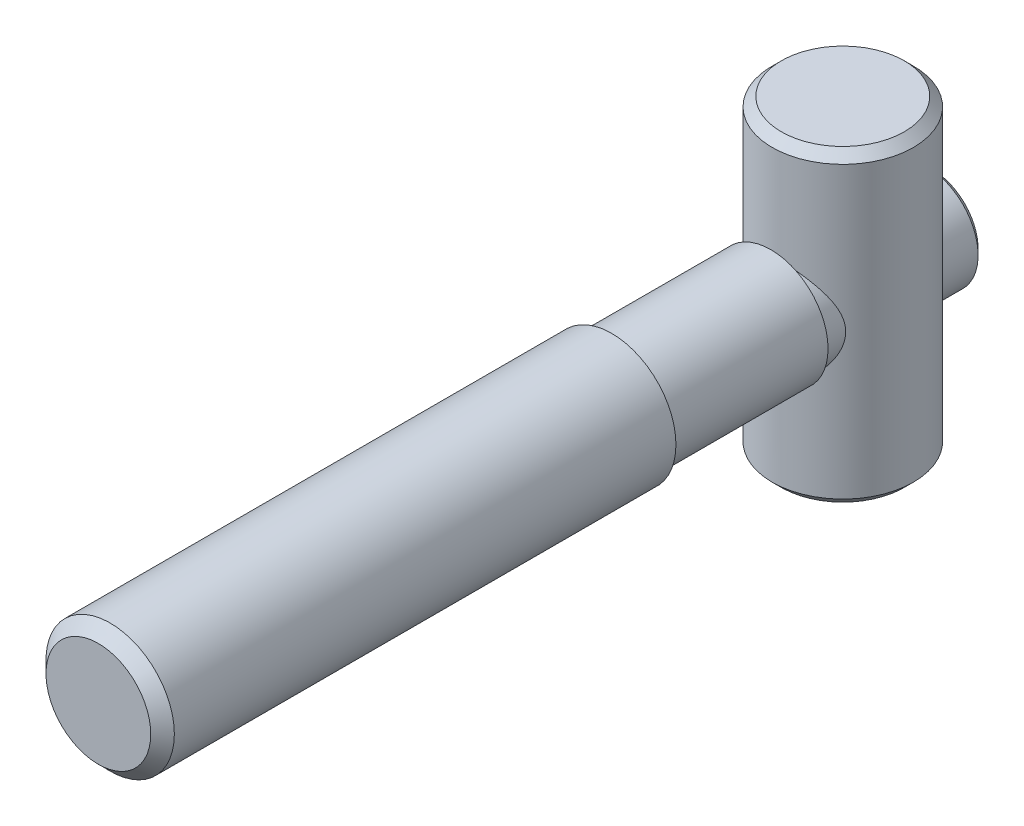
ISO-10303-21;
HEADER;
FILE_DESCRIPTION(('STEP AP214'),'2;1');
FILE_NAME('part.step','',(''),(''),'','','');
FILE_SCHEMA(('AUTOMOTIVE_DESIGN { 1 0 10303 214 1 1 1 1 }'));
ENDSEC;
DATA;
#1=APPLICATION_CONTEXT('core data for automotive mechanical design processes');
#2=APPLICATION_PROTOCOL_DEFINITION('international standard','automotive_design',2000,#1);
#3=PRODUCT_CONTEXT('',#1,'mechanical');
#4=PRODUCT('Part','Part','',(#3));
#5=PRODUCT_RELATED_PRODUCT_CATEGORY('part','',(#4));
#6=PRODUCT_DEFINITION_FORMATION('','',#4);
#7=PRODUCT_DEFINITION_CONTEXT('part definition',#1,'design');
#8=PRODUCT_DEFINITION('design','',#6,#7);
#9=PRODUCT_DEFINITION_SHAPE('','',#8);
#10=(LENGTH_UNIT() NAMED_UNIT(*) SI_UNIT(.MILLI.,.METRE.));
#11=(NAMED_UNIT(*) PLANE_ANGLE_UNIT() SI_UNIT($,.RADIAN.));
#12=(NAMED_UNIT(*) SI_UNIT($,.STERADIAN.) SOLID_ANGLE_UNIT());
#13=UNCERTAINTY_MEASURE_WITH_UNIT(LENGTH_MEASURE(1.E-05),#10,'distance_accuracy_value','');
#14=(GEOMETRIC_REPRESENTATION_CONTEXT(3) GLOBAL_UNCERTAINTY_ASSIGNED_CONTEXT((#13)) GLOBAL_UNIT_ASSIGNED_CONTEXT((#10,
#11,#12)) REPRESENTATION_CONTEXT('',''));
#15=CARTESIAN_POINT('',(0.,0.,0.));
#16=DIRECTION('',(0.,0.,1.));
#17=DIRECTION('',(1.,0.,0.));
#18=AXIS2_PLACEMENT_3D('',#15,#16,#17);
#19=CARTESIAN_POINT('',(0.,-12.,-18.3));
#20=DIRECTION('',(0.,-1.,0.));
#21=DIRECTION('',(-1.,0.,0.));
#22=AXIS2_PLACEMENT_3D('',#19,#20,#21);
#23=PLANE('',#22);
#24=CARTESIAN_POINT('',(0.,-12.,-18.3));
#25=DIRECTION('',(0.,-1.,0.));
#26=DIRECTION('',(-1.,0.,0.));
#27=AXIS2_PLACEMENT_3D('',#24,#25,#26);
#28=CIRCLE('',#27,4.79289321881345);
#29=CARTESIAN_POINT('',(-4.79289321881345,-12.,-18.3));
#30=VERTEX_POINT('',#29);
#31=EDGE_CURVE('E145',#30,#30,#28,.T.);
#32=ORIENTED_EDGE('',*,*,#31,.T.);
#33=EDGE_LOOP('',(#32));
#34=FACE_BOUND('',#33,.T.);
#35=ADVANCED_FACE('F14',(#34),#23,.T.);
#36=CARTESIAN_POINT('',(0.,12.,-18.3));
#37=DIRECTION('',(0.,1.,0.));
#38=DIRECTION('',(1.,0.,0.));
#39=AXIS2_PLACEMENT_3D('',#36,#37,#38);
#40=PLANE('',#39);
#41=CARTESIAN_POINT('',(0.,12.,-18.3));
#42=DIRECTION('',(0.,1.,0.));
#43=DIRECTION('',(1.,0.,0.));
#44=AXIS2_PLACEMENT_3D('',#41,#42,#43);
#45=CIRCLE('',#44,4.79289321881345);
#46=CARTESIAN_POINT('',(4.79289321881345,12.,-18.3));
#47=VERTEX_POINT('',#46);
#48=EDGE_CURVE('E9',#47,#47,#45,.T.);
#49=ORIENTED_EDGE('',*,*,#48,.T.);
#50=EDGE_LOOP('',(#49));
#51=FACE_BOUND('',#50,.T.);
#52=ADVANCED_FACE('F181',(#51),#40,.T.);
#53=CARTESIAN_POINT('',(0.,-12.,-18.3));
#54=DIRECTION('',(0.,1.,0.));
#55=DIRECTION('',(1.,0.,0.));
#56=AXIS2_PLACEMENT_3D('',#53,#54,#55);
#57=CONICAL_SURFACE('',#56,4.79289321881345,0.785398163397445);
#58=CARTESIAN_POINT('',(0.,-11.2928932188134,-18.3));
#59=DIRECTION('',(0.,-1.,0.));
#60=DIRECTION('',(-1.,0.,0.));
#61=AXIS2_PLACEMENT_3D('',#58,#59,#60);
#62=CIRCLE('',#61,5.5);
#63=CARTESIAN_POINT('',(-5.5,-11.2928932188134,-18.3));
#64=VERTEX_POINT('',#63);
#65=EDGE_CURVE('E23',#64,#64,#62,.F.);
#66=ORIENTED_EDGE('',*,*,#65,.F.);
#67=EDGE_LOOP('',(#66));
#68=FACE_BOUND('',#67,.T.);
#69=ORIENTED_EDGE('',*,*,#31,.F.);
#70=EDGE_LOOP('',(#69));
#71=FACE_BOUND('',#70,.T.);
#72=ADVANCED_FACE('F183',(#68,#71),#57,.T.);
#73=CARTESIAN_POINT('',(0.,12.,-18.3));
#74=DIRECTION('',(0.,-1.,0.));
#75=DIRECTION('',(-1.,0.,0.));
#76=AXIS2_PLACEMENT_3D('',#73,#74,#75);
#77=CONICAL_SURFACE('',#76,4.79289321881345,0.785398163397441);
#78=CARTESIAN_POINT('',(0.,11.2928932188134,-18.3));
#79=DIRECTION('',(0.,1.,0.));
#80=DIRECTION('',(1.,0.,0.));
#81=AXIS2_PLACEMENT_3D('',#78,#79,#80);
#82=CIRCLE('',#81,5.5);
#83=CARTESIAN_POINT('',(5.5,11.2928932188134,-18.3));
#84=VERTEX_POINT('',#83);
#85=EDGE_CURVE('E149',#84,#84,#82,.F.);
#86=ORIENTED_EDGE('',*,*,#85,.F.);
#87=EDGE_LOOP('',(#86));
#88=FACE_BOUND('',#87,.T.);
#89=ORIENTED_EDGE('',*,*,#48,.F.);
#90=EDGE_LOOP('',(#89));
#91=FACE_BOUND('',#90,.T.);
#92=ADVANCED_FACE('F174',(#88,#91),#77,.T.);
#93=CARTESIAN_POINT('',(0.,12.,-18.3));
#94=DIRECTION('',(0.,1.,0.));
#95=DIRECTION('',(1.,0.,0.));
#96=AXIS2_PLACEMENT_3D('',#93,#94,#95);
#97=CYLINDRICAL_SURFACE('',#96,5.5);
#98=DIRECTION('',(0.,1.,0.));
#99=VECTOR('',#98,1.);
#100=CARTESIAN_POINT('',(0.6,12.,-23.7671747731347));
#101=LINE('',#100,#99);
#102=CARTESIAN_POINT('',(0.6,-3.95474398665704,-23.7671747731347));
#103=VERTEX_POINT('',#102);
#104=CARTESIAN_POINT('',(0.6,3.95474398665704,-23.7671747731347));
#105=VERTEX_POINT('',#104);
#106=EDGE_CURVE('E81',#103,#105,#101,.T.);
#107=ORIENTED_EDGE('',*,*,#106,.F.);
#108=CARTESIAN_POINT('',(4.,0.,-22.0749172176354));
#109=CARTESIAN_POINT('',(3.99999971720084,0.094559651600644,-22.0749177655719));
#110=CARTESIAN_POINT('',(3.99663873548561,0.189122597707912,-22.078488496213));
#111=CARTESIAN_POINT('',(3.98328406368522,0.377297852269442,-22.0925637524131));
#112=CARTESIAN_POINT('',(3.97328671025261,0.470909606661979,-22.1030721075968));
#113=CARTESIAN_POINT('',(3.94687649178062,0.65648336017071,-22.1304732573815));
#114=CARTESIAN_POINT('',(3.93044906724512,0.748441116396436,-22.1473805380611));
#115=CARTESIAN_POINT('',(3.89152450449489,0.929870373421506,-22.1867470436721));
#116=CARTESIAN_POINT('',(3.86902376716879,1.01934036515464,-22.2092095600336));
#117=CARTESIAN_POINT('',(3.79365509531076,1.28093397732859,-22.2828450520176));
#118=CARTESIAN_POINT('',(3.73252985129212,1.44885844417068,-22.3407009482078));
#119=CARTESIAN_POINT('',(3.590688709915,1.77146295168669,-22.4672506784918));
#120=CARTESIAN_POINT('',(3.50997431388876,1.92614400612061,-22.5359436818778));
#121=CARTESIAN_POINT('',(3.31318173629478,2.25065582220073,-22.6922095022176));
#122=CARTESIAN_POINT('',(3.19328494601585,2.41764951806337,-22.7808675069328));
#123=CARTESIAN_POINT('',(2.92908108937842,2.73178094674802,-22.9578760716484));
#124=CARTESIAN_POINT('',(2.78474090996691,2.87889125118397,-23.0462260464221));
#125=CARTESIAN_POINT('',(2.5362822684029,3.09553636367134,-23.1814353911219));
#126=CARTESIAN_POINT('',(2.43963284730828,3.17231415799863,-23.2305740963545));
#127=CARTESIAN_POINT('',(2.23844845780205,3.31733570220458,-23.3251054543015));
#128=CARTESIAN_POINT('',(2.13391712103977,3.38558334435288,-23.3704998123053));
#129=CARTESIAN_POINT('',(1.91752007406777,3.51266692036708,-23.4562228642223));
#130=CARTESIAN_POINT('',(1.80566515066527,3.57151627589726,-23.49655876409));
#131=CARTESIAN_POINT('',(1.57523382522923,3.67896799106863,-23.5709873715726));
#132=CARTESIAN_POINT('',(1.45666071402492,3.72757531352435,-23.6050831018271));
#133=CARTESIAN_POINT('',(1.16188171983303,3.83193503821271,-23.678830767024));
#134=CARTESIAN_POINT('',(0.982606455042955,3.88193864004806,-23.7146815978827));
#135=CARTESIAN_POINT('',(0.616370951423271,3.95663720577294,-23.7684829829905));
#136=CARTESIAN_POINT('',(0.429417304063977,3.98135342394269,-23.7864485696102));
#137=CARTESIAN_POINT('',(0.052567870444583,4.00411402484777,-23.8029868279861));
#138=CARTESIAN_POINT('',(-0.137333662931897,4.00209732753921,-23.8015150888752));
#139=CARTESIAN_POINT('',(-0.51380986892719,3.97135939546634,-23.7791958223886));
#140=CARTESIAN_POINT('',(-0.700383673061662,3.94263129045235,-23.7583433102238));
#141=CARTESIAN_POINT('',(-1.05962164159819,3.86136821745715,-23.699944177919));
#142=CARTESIAN_POINT('',(-1.23253206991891,3.80954610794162,-23.6628980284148));
#143=CARTESIAN_POINT('',(-1.56671343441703,3.68473335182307,-23.5749694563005));
#144=CARTESIAN_POINT('',(-1.72798199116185,3.61173839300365,-23.5240842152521));
#145=CARTESIAN_POINT('',(-2.05370310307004,3.43803005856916,-23.4054456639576));
#146=CARTESIAN_POINT('',(-2.2165364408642,3.33514439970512,-23.3364494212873));
#147=CARTESIAN_POINT('',(-2.52348319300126,3.10940476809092,-23.189889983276));
#148=CARTESIAN_POINT('',(-2.66757825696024,2.98653148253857,-23.1123185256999));
#149=CARTESIAN_POINT('',(-2.96150593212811,2.69807007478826,-22.9383041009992));
#150=CARTESIAN_POINT('',(-3.10726104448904,2.52879913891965,-22.8410685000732));
#151=CARTESIAN_POINT('',(-3.36953999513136,2.16705523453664,-22.6499971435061));
#152=CARTESIAN_POINT('',(-3.48605965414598,1.97457895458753,-22.556161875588));
#153=CARTESIAN_POINT('',(-3.66526169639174,1.61165125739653,-22.402032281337));
#154=CARTESIAN_POINT('',(-3.73414032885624,1.44549066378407,-22.3388789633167));
#155=CARTESIAN_POINT('',(-3.84985589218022,1.10068331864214,-22.2287430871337));
#156=CARTESIAN_POINT('',(-3.89674227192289,0.922065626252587,-22.1817243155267));
#157=CARTESIAN_POINT('',(-3.9599937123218,0.585461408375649,-22.1170906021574));
#158=CARTESIAN_POINT('',(-3.98009730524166,0.428880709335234,-22.0959235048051));
#159=CARTESIAN_POINT('',(-4.00152507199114,0.113064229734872,-22.0733369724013));
#160=CARTESIAN_POINT('',(-4.00286519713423,-0.0461691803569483,-22.0719007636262));
#161=CARTESIAN_POINT('',(-3.98669865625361,-0.362327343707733,-22.0889767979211));
#162=CARTESIAN_POINT('',(-3.96921589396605,-0.519254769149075,-22.1074637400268));
#163=CARTESIAN_POINT('',(-3.91666535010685,-0.82717652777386,-22.1614916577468));
#164=CARTESIAN_POINT('',(-3.88157034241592,-0.978161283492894,-22.1970590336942));
#165=CARTESIAN_POINT('',(-3.77812999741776,-1.33113055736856,-22.2978469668));
#166=CARTESIAN_POINT('',(-3.70207893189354,-1.52906623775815,-22.3692423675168));
#167=CARTESIAN_POINT('',(-3.52270580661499,-1.90640842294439,-22.5254840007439));
#168=CARTESIAN_POINT('',(-3.41932922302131,-2.08577687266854,-22.6103569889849));
#169=CARTESIAN_POINT('',(-3.18411833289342,-2.43025180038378,-22.7870574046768));
#170=CARTESIAN_POINT('',(-3.05152555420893,-2.59477148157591,-22.8790168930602));
#171=CARTESIAN_POINT('',(-2.76125147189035,-2.90173861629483,-23.059699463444));
#172=CARTESIAN_POINT('',(-2.6035911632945,-3.04420434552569,-23.1484251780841));
#173=CARTESIAN_POINT('',(-2.271539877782,-3.2987599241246,-23.3122631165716));
#174=CARTESIAN_POINT('',(-2.09818660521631,-3.41190835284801,-23.3878018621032));
#175=CARTESIAN_POINT('',(-1.82330793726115,-3.56180731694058,-23.4899086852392));
#176=CARTESIAN_POINT('',(-1.72916099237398,-3.6084863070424,-23.5220894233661));
#177=CARTESIAN_POINT('',(-1.53632285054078,-3.69470582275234,-23.5820343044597));
#178=CARTESIAN_POINT('',(-1.43763386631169,-3.73424977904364,-23.6098005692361));
#179=CARTESIAN_POINT('',(-1.23534308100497,-3.80598862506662,-23.6604944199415));
#180=CARTESIAN_POINT('',(-1.13170490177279,-3.83811376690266,-23.683375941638));
#181=CARTESIAN_POINT('',(-0.921160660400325,-3.89401032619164,-23.7233693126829));
#182=CARTESIAN_POINT('',(-0.81425636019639,-3.9177861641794,-23.7404842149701));
#183=CARTESIAN_POINT('',(-0.598125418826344,-3.95655048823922,-23.7684652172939));
#184=CARTESIAN_POINT('',(-0.488900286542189,-3.9715445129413,-23.7793352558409));
#185=CARTESIAN_POINT('',(-0.269138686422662,-3.9924605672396,-23.7945144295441));
#186=CARTESIAN_POINT('',(-0.15860243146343,-3.99838404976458,-23.7988246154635));
#187=CARTESIAN_POINT('',(0.0467313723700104,-4.00084937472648,-23.8006178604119));
#188=CARTESIAN_POINT('',(0.141509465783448,-3.99861635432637,-23.7989924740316));
#189=CARTESIAN_POINT('',(0.330490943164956,-3.98744748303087,-23.7908762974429));
#190=CARTESIAN_POINT('',(0.424694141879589,-3.97850957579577,-23.7843840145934));
#191=CARTESIAN_POINT('',(0.611759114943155,-3.95406659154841,-23.7666782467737));
#192=CARTESIAN_POINT('',(0.704621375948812,-3.93856396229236,-23.7554665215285));
#193=CARTESIAN_POINT('',(0.88841574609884,-3.90122128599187,-23.7285691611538));
#194=CARTESIAN_POINT('',(0.979347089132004,-3.87937877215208,-23.7128817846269));
#195=CARTESIAN_POINT('',(1.24445933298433,-3.80583624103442,-23.6603363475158));
#196=CARTESIAN_POINT('',(1.41518501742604,-3.74554675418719,-23.6175701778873));
#197=CARTESIAN_POINT('',(1.74369677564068,-3.60438289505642,-23.5191022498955));
#198=CARTESIAN_POINT('',(1.90148075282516,-3.5235051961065,-23.4633984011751));
#199=CARTESIAN_POINT('',(2.22228203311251,-3.33179335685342,-23.3343972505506));
#200=CARTESIAN_POINT('',(2.38322541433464,-3.21841054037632,-23.2597469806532));
#201=CARTESIAN_POINT('',(2.68497920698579,-2.97136345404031,-23.103106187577));
#202=CARTESIAN_POINT('',(2.82576198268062,-2.8376718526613,-23.0211058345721));
#203=CARTESIAN_POINT('',(3.03332548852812,-2.61000808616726,-22.8888332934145));
#204=CARTESIAN_POINT('',(3.10699576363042,-2.5218601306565,-22.839152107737));
#205=CARTESIAN_POINT('',(3.24665706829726,-2.3393224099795,-22.7403298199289));
#206=CARTESIAN_POINT('',(3.31264615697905,-2.24493107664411,-22.69118885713));
#207=CARTESIAN_POINT('',(3.43660180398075,-2.0501419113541,-22.5948719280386));
#208=CARTESIAN_POINT('',(3.49457298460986,-1.94974758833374,-22.5476948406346));
#209=CARTESIAN_POINT('',(3.6021255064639,-1.74306577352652,-22.4568795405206));
#210=CARTESIAN_POINT('',(3.6517073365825,-1.63677862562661,-22.4132411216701));
#211=CARTESIAN_POINT('',(3.76078752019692,-1.37275858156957,-22.3142162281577));
#212=CARTESIAN_POINT('',(3.81580236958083,-1.21205137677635,-22.2615166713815));
#213=CARTESIAN_POINT('',(3.88309107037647,-0.963817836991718,-22.1952018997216));
#214=CARTESIAN_POINT('',(3.90296834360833,-0.879972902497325,-22.1752342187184));
#215=CARTESIAN_POINT('',(3.93739985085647,-0.710192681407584,-22.1402454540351));
#216=CARTESIAN_POINT('',(3.95195647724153,-0.62425835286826,-22.1252221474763));
#217=CARTESIAN_POINT('',(3.97571410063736,-0.449073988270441,-22.1005263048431));
#218=CARTESIAN_POINT('',(3.98480070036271,-0.359792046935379,-22.0909682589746));
#219=CARTESIAN_POINT('',(3.99694447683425,-0.180341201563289,-22.0781627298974));
#220=CARTESIAN_POINT('',(4.00000026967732,-0.0901720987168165,-22.0749166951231));
#221=CARTESIAN_POINT('',(4.,0.,-22.0749172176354));
#222=B_SPLINE_CURVE_WITH_KNOTS('',3,(#108,#109,#110,#111,#112,#113,#114,#115,#116,#117,#118,
#119,#120,#121,#122,#123,#124,#125,#126,#127,#128,#129,#130,#131,#132,#133,#134,#135,#136,#137,
#138,#139,#140,#141,#142,#143,#144,#145,#146,#147,#148,#149,#150,#151,#152,#153,#154,#155,#156,
#157,#158,#159,#160,#161,#162,#163,#164,#165,#166,#167,#168,#169,#170,#171,#172,#173,#174,#175,
#176,#177,#178,#179,#180,#181,#182,#183,#184,#185,#186,#187,#188,#189,#190,#191,#192,#193,#194,
#195,#196,#197,#198,#199,#200,#201,#202,#203,#204,#205,#206,#207,#208,#209,#210,#211,#212,#213,
#214,#215,#216,#217,#218,#219,#220,#221),.UNSPECIFIED.,.T.,.F.,(4,2,2,2,2,2,2,2,2,2,2,2,2,2,2,2,
2,2,2,2,2,2,2,2,2,2,2,2,2,2,2,2,2,2,2,2,2,2,2,2,2,2,2,2,2,2,2,2,2,2,2,2,2,2,2,2,4),(0.,
0.283560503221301,0.567277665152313,0.851640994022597,1.13617321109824,1.69729774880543,
2.25837929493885,2.92774006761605,3.59801497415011,3.99610080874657,4.39400433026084,
4.79133442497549,5.18847154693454,5.75445889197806,6.31997012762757,6.88677367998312,
7.45372305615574,8.00426875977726,8.5549266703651,9.16646484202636,9.77859745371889,
10.5066073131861,11.2347211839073,11.8047550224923,12.3735009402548,12.8491941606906,
13.3244829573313,13.7991688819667,14.2745908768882,14.94214771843,15.6110467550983,
16.2999460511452,16.9882713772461,17.6463931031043,17.9757519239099,18.3049519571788,
18.6371312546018,18.9691344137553,19.3009279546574,19.6326683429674,19.9167672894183,
20.2009534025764,20.4850336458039,20.7692245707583,21.3249022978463,21.8806698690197,
22.5100347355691,23.1402542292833,23.5154020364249,23.8906444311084,24.2656695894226,
24.6406728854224,25.1720162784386,25.4371121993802,25.7020887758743,25.9724300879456,
26.24283342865),.UNSPECIFIED.);
#223=EDGE_CURVE('E76',#103,#105,#222,.T.);
#224=ORIENTED_EDGE('',*,*,#223,.T.);
#225=EDGE_LOOP('',(#107,#224));
#226=FACE_BOUND('',#225,.T.);
#227=ORIENTED_EDGE('',*,*,#85,.T.);
#228=EDGE_LOOP('',(#227));
#229=FACE_BOUND('',#228,.T.);
#230=ORIENTED_EDGE('',*,*,#65,.T.);
#231=EDGE_LOOP('',(#230));
#232=FACE_BOUND('',#231,.T.);
#233=CARTESIAN_POINT('',(4.,0.,-14.5250827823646));
#234=CARTESIAN_POINT('',(3.99999971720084,-0.0945596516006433,-14.5250822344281));
#235=CARTESIAN_POINT('',(3.99663873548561,-0.189122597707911,-14.521511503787));
#236=CARTESIAN_POINT('',(3.98328406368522,-0.37729785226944,-14.5074362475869));
#237=CARTESIAN_POINT('',(3.97328671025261,-0.470909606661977,-14.4969278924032));
#238=CARTESIAN_POINT('',(3.94687649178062,-0.65648336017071,-14.4695267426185));
#239=CARTESIAN_POINT('',(3.93044906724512,-0.748441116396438,-14.4526194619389));
#240=CARTESIAN_POINT('',(3.89152450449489,-0.929870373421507,-14.4132529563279));
#241=CARTESIAN_POINT('',(3.86902376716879,-1.01934036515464,-14.3907904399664));
#242=CARTESIAN_POINT('',(3.79365509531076,-1.28093397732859,-14.3171549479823));
#243=CARTESIAN_POINT('',(3.73252985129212,-1.44885844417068,-14.2592990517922));
#244=CARTESIAN_POINT('',(3.590688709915,-1.7714629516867,-14.1327493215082));
#245=CARTESIAN_POINT('',(3.50997431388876,-1.92614400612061,-14.0640563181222));
#246=CARTESIAN_POINT('',(3.31318173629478,-2.25065582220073,-13.9077904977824));
#247=CARTESIAN_POINT('',(3.19328494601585,-2.41764951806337,-13.8191324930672));
#248=CARTESIAN_POINT('',(2.92908108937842,-2.73178094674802,-13.6421239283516));
#249=CARTESIAN_POINT('',(2.78474090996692,-2.87889125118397,-13.5537739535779));
#250=CARTESIAN_POINT('',(2.53628226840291,-3.09553636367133,-13.4185646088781));
#251=CARTESIAN_POINT('',(2.43963284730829,-3.17231415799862,-13.3694259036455));
#252=CARTESIAN_POINT('',(2.23844845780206,-3.31733570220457,-13.2748945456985));
#253=CARTESIAN_POINT('',(2.13391712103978,-3.38558334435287,-13.2295001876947));
#254=CARTESIAN_POINT('',(1.91752007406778,-3.51266692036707,-13.1437771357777));
#255=CARTESIAN_POINT('',(1.80566515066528,-3.57151627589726,-13.10344123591));
#256=CARTESIAN_POINT('',(1.57523382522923,-3.67896799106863,-13.0290126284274));
#257=CARTESIAN_POINT('',(1.45666071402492,-3.72757531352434,-12.9949168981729));
#258=CARTESIAN_POINT('',(1.16188171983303,-3.83193503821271,-12.921169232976));
#259=CARTESIAN_POINT('',(0.982606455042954,-3.88193864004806,-12.8853184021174));
#260=CARTESIAN_POINT('',(0.616370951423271,-3.95663720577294,-12.8315170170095));
#261=CARTESIAN_POINT('',(0.429417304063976,-3.98135342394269,-12.8135514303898));
#262=CARTESIAN_POINT('',(0.0525678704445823,-4.00411402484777,-12.7970131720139));
#263=CARTESIAN_POINT('',(-0.137333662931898,-4.00209732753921,-12.7984849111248));
#264=CARTESIAN_POINT('',(-0.51380986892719,-3.97135939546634,-12.8208041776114));
#265=CARTESIAN_POINT('',(-0.700383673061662,-3.94263129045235,-12.8416566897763));
#266=CARTESIAN_POINT('',(-1.05962164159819,-3.86136821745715,-12.900055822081));
#267=CARTESIAN_POINT('',(-1.23253206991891,-3.80954610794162,-12.9371019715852));
#268=CARTESIAN_POINT('',(-1.56671343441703,-3.68473335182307,-13.0250305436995));
#269=CARTESIAN_POINT('',(-1.72798199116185,-3.61173839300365,-13.0759157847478));
#270=CARTESIAN_POINT('',(-2.05370310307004,-3.43803005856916,-13.1945543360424));
#271=CARTESIAN_POINT('',(-2.2165364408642,-3.33514439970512,-13.2635505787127));
#272=CARTESIAN_POINT('',(-2.52348319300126,-3.10940476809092,-13.410110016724));
#273=CARTESIAN_POINT('',(-2.66757825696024,-2.98653148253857,-13.4876814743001));
#274=CARTESIAN_POINT('',(-2.96150593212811,-2.69807007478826,-13.6616958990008));
#275=CARTESIAN_POINT('',(-3.10726104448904,-2.52879913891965,-13.7589314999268));
#276=CARTESIAN_POINT('',(-3.36953999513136,-2.16705523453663,-13.9500028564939));
#277=CARTESIAN_POINT('',(-3.48605965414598,-1.97457895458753,-14.043838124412));
#278=CARTESIAN_POINT('',(-3.66526169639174,-1.61165125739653,-14.197967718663));
#279=CARTESIAN_POINT('',(-3.73414032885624,-1.44549066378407,-14.2611210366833));
#280=CARTESIAN_POINT('',(-3.84985589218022,-1.10068331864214,-14.3712569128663));
#281=CARTESIAN_POINT('',(-3.8967422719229,-0.922065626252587,-14.4182756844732));
#282=CARTESIAN_POINT('',(-3.95999371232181,-0.585461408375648,-14.4829093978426));
#283=CARTESIAN_POINT('',(-3.98009730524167,-0.428880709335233,-14.5040764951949));
#284=CARTESIAN_POINT('',(-4.00152507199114,-0.113064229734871,-14.5266630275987));
#285=CARTESIAN_POINT('',(-4.00286519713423,0.0461691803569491,-14.5280992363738));
#286=CARTESIAN_POINT('',(-3.98669865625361,0.362327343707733,-14.5110232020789));
#287=CARTESIAN_POINT('',(-3.96921589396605,0.519254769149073,-14.4925362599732));
#288=CARTESIAN_POINT('',(-3.91666535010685,0.827176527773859,-14.4385083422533));
#289=CARTESIAN_POINT('',(-3.88157034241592,0.978161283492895,-14.4029409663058));
#290=CARTESIAN_POINT('',(-3.77812999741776,1.33113055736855,-14.3021530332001));
#291=CARTESIAN_POINT('',(-3.70207893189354,1.52906623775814,-14.2307576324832));
#292=CARTESIAN_POINT('',(-3.522705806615,1.90640842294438,-14.0745159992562));
#293=CARTESIAN_POINT('',(-3.41932922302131,2.08577687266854,-13.9896430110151));
#294=CARTESIAN_POINT('',(-3.18411833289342,2.43025180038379,-13.8129425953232));
#295=CARTESIAN_POINT('',(-3.05152555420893,2.59477148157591,-13.7209831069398));
#296=CARTESIAN_POINT('',(-2.76125147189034,2.90173861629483,-13.540300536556));
#297=CARTESIAN_POINT('',(-2.6035911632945,3.04420434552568,-13.4515748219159));
#298=CARTESIAN_POINT('',(-2.271539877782,3.2987599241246,-13.2877368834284));
#299=CARTESIAN_POINT('',(-2.09818660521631,3.41190835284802,-13.2121981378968));
#300=CARTESIAN_POINT('',(-1.82330793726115,3.56180731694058,-13.1100913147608));
#301=CARTESIAN_POINT('',(-1.72916099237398,3.6084863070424,-13.0779105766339));
#302=CARTESIAN_POINT('',(-1.53632285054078,3.69470582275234,-13.0179656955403));
#303=CARTESIAN_POINT('',(-1.43763386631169,3.73424977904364,-12.990199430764));
#304=CARTESIAN_POINT('',(-1.23534308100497,3.80598862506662,-12.9395055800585));
#305=CARTESIAN_POINT('',(-1.13170490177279,3.83811376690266,-12.916624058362));
#306=CARTESIAN_POINT('',(-0.921160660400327,3.89401032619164,-12.8766306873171));
#307=CARTESIAN_POINT('',(-0.814256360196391,3.9177861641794,-12.8595157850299));
#308=CARTESIAN_POINT('',(-0.598125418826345,3.95655048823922,-12.8315347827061));
#309=CARTESIAN_POINT('',(-0.488900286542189,3.9715445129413,-12.8206647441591));
#310=CARTESIAN_POINT('',(-0.269138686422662,3.9924605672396,-12.8054855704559));
#311=CARTESIAN_POINT('',(-0.158602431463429,3.99838404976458,-12.8011753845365));
#312=CARTESIAN_POINT('',(0.046731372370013,4.00084937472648,-12.7993821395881));
#313=CARTESIAN_POINT('',(0.141509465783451,3.99861635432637,-12.8010075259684));
#314=CARTESIAN_POINT('',(0.330490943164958,3.98744748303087,-12.8091237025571));
#315=CARTESIAN_POINT('',(0.424694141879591,3.97850957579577,-12.8156159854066));
#316=CARTESIAN_POINT('',(0.611759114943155,3.95406659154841,-12.8333217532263));
#317=CARTESIAN_POINT('',(0.704621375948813,3.93856396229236,-12.8445334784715));
#318=CARTESIAN_POINT('',(0.88841574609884,3.90122128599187,-12.8714308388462));
#319=CARTESIAN_POINT('',(0.979347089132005,3.87937877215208,-12.8871182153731));
#320=CARTESIAN_POINT('',(1.24445933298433,3.80583624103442,-12.9396636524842));
#321=CARTESIAN_POINT('',(1.41518501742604,3.74554675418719,-12.9824298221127));
#322=CARTESIAN_POINT('',(1.74369677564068,3.60438289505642,-13.0808977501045));
#323=CARTESIAN_POINT('',(1.90148075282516,3.5235051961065,-13.1366015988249));
#324=CARTESIAN_POINT('',(2.22228203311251,3.33179335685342,-13.2656027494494));
#325=CARTESIAN_POINT('',(2.38322541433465,3.21841054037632,-13.3402530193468));
#326=CARTESIAN_POINT('',(2.68497920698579,2.97136345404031,-13.496893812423));
#327=CARTESIAN_POINT('',(2.82576198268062,2.8376718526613,-13.5788941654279));
#328=CARTESIAN_POINT('',(3.03332548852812,2.61000808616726,-13.7111667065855));
#329=CARTESIAN_POINT('',(3.10699576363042,2.5218601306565,-13.760847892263));
#330=CARTESIAN_POINT('',(3.24665706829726,2.33932240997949,-13.8596701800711));
#331=CARTESIAN_POINT('',(3.31264615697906,2.24493107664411,-13.9088111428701));
#332=CARTESIAN_POINT('',(3.43660180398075,2.05014191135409,-14.0051280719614));
#333=CARTESIAN_POINT('',(3.49457298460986,1.94974758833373,-14.0523051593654));
#334=CARTESIAN_POINT('',(3.60212550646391,1.74306577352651,-14.1431204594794));
#335=CARTESIAN_POINT('',(3.65170733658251,1.6367786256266,-14.18675887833));
#336=CARTESIAN_POINT('',(3.76078752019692,1.37275858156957,-14.2857837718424));
#337=CARTESIAN_POINT('',(3.81580236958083,1.21205137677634,-14.3384833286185));
#338=CARTESIAN_POINT('',(3.88309107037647,0.963817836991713,-14.4047981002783));
#339=CARTESIAN_POINT('',(3.90296834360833,0.879972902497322,-14.4247657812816));
#340=CARTESIAN_POINT('',(3.93739985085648,0.71019268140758,-14.4597545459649));
#341=CARTESIAN_POINT('',(3.95195647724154,0.624258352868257,-14.4747778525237));
#342=CARTESIAN_POINT('',(3.97571410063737,0.449073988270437,-14.4994736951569));
#343=CARTESIAN_POINT('',(3.98480070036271,0.359792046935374,-14.5090317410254));
#344=CARTESIAN_POINT('',(3.99694447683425,0.180341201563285,-14.5218372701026));
#345=CARTESIAN_POINT('',(4.00000026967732,0.0901720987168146,-14.525083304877));
#346=CARTESIAN_POINT('',(4.,0.,-14.5250827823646));
#347=B_SPLINE_CURVE_WITH_KNOTS('',3,(#233,#234,#235,#236,#237,#238,#239,#240,#241,#242,#243,
#244,#245,#246,#247,#248,#249,#250,#251,#252,#253,#254,#255,#256,#257,#258,#259,#260,#261,#262,
#263,#264,#265,#266,#267,#268,#269,#270,#271,#272,#273,#274,#275,#276,#277,#278,#279,#280,#281,
#282,#283,#284,#285,#286,#287,#288,#289,#290,#291,#292,#293,#294,#295,#296,#297,#298,#299,#300,
#301,#302,#303,#304,#305,#306,#307,#308,#309,#310,#311,#312,#313,#314,#315,#316,#317,#318,#319,
#320,#321,#322,#323,#324,#325,#326,#327,#328,#329,#330,#331,#332,#333,#334,#335,#336,#337,#338,
#339,#340,#341,#342,#343,#344,#345,#346),.UNSPECIFIED.,.T.,.F.,(4,2,2,2,2,2,2,2,2,2,2,2,2,2,2,2,
2,2,2,2,2,2,2,2,2,2,2,2,2,2,2,2,2,2,2,2,2,2,2,2,2,2,2,2,2,2,2,2,2,2,2,2,2,2,2,2,4),(0.,
0.2835605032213,0.567277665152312,0.851640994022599,1.13617321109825,1.69729774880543,
2.25837929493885,2.92774006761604,3.59801497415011,3.99610080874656,4.39400433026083,
4.79133442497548,5.18847154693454,5.75445889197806,6.31997012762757,6.88677367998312,
7.45372305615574,8.00426875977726,8.5549266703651,9.16646484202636,9.77859745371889,
10.5066073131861,11.2347211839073,11.8047550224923,12.3735009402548,12.8491941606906,
13.3244829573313,13.7991688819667,14.2745908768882,14.94214771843,15.6110467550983,
16.2999460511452,16.9882713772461,17.6463931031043,17.9757519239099,18.3049519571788,
18.6371312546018,18.9691344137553,19.3009279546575,19.6326683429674,19.9167672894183,
20.2009534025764,20.4850336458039,20.7692245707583,21.3249022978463,21.8806698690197,
22.5100347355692,23.1402542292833,23.5154020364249,23.8906444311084,24.2656695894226,
24.6406728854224,25.1720162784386,25.4371121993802,25.7020887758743,25.9724300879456,
26.24283342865),.UNSPECIFIED.);
#348=CARTESIAN_POINT('',(4.,0.,-14.5250827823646));
#349=VERTEX_POINT('',#348);
#350=EDGE_CURVE('E164',#349,#349,#347,.T.);
#351=ORIENTED_EDGE('',*,*,#350,.T.);
#352=EDGE_LOOP('',(#351));
#353=FACE_BOUND('',#352,.T.);
#354=CARTESIAN_POINT('',(-0.6,3.95474398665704,-23.7671747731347));
#355=VERTEX_POINT('',#354);
#356=CARTESIAN_POINT('',(-0.6,-3.95474398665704,-23.7671747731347));
#357=VERTEX_POINT('',#356);
#358=EDGE_CURVE('E66',#355,#357,#222,.T.);
#359=ORIENTED_EDGE('',*,*,#358,.T.);
#360=DIRECTION('',(0.,1.,0.));
#361=VECTOR('',#360,1.);
#362=CARTESIAN_POINT('',(-0.6,12.,-23.7671747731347));
#363=LINE('',#362,#361);
#364=EDGE_CURVE('E77',#357,#355,#363,.T.);
#365=ORIENTED_EDGE('',*,*,#364,.T.);
#366=EDGE_LOOP('',(#359,#365));
#367=FACE_BOUND('',#366,.T.);
#368=ADVANCED_FACE('F79',(#226,#229,#232,#353,#367),#97,.T.);
#369=CARTESIAN_POINT('',(0.,0.,24.7));
#370=DIRECTION('',(0.,0.,1.));
#371=DIRECTION('',(1.,0.,0.));
#372=AXIS2_PLACEMENT_3D('',#369,#370,#371);
#373=CYLINDRICAL_SURFACE('',#372,5.);
#374=CARTESIAN_POINT('',(0.,0.,-0.300000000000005));
#375=DIRECTION('',(0.,0.,1.));
#376=DIRECTION('',(1.,0.,0.));
#377=AXIS2_PLACEMENT_3D('',#374,#375,#376);
#378=CIRCLE('',#377,5.);
#379=CARTESIAN_POINT('',(5.,0.,-0.300000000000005));
#380=VERTEX_POINT('',#379);
#381=EDGE_CURVE('E105',#380,#380,#378,.T.);
#382=ORIENTED_EDGE('',*,*,#381,.T.);
#383=EDGE_LOOP('',(#382));
#384=FACE_BOUND('',#383,.T.);
#385=CARTESIAN_POINT('',(0.,0.,38.78));
#386=DIRECTION('',(0.,0.,1.));
#387=DIRECTION('',(1.,0.,0.));
#388=AXIS2_PLACEMENT_3D('',#385,#386,#387);
#389=CIRCLE('',#388,5.);
#390=CARTESIAN_POINT('',(5.,0.,38.78));
#391=VERTEX_POINT('',#390);
#392=EDGE_CURVE('E215',#391,#391,#389,.T.);
#393=ORIENTED_EDGE('',*,*,#392,.F.);
#394=EDGE_LOOP('',(#393));
#395=FACE_BOUND('',#394,.T.);
#396=ADVANCED_FACE('F134',(#384,#395),#373,.T.);
#397=CARTESIAN_POINT('',(0.,0.,-0.300000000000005));
#398=DIRECTION('',(0.,0.,1.));
#399=DIRECTION('',(1.,0.,0.));
#400=AXIS2_PLACEMENT_3D('',#397,#398,#399);
#401=PLANE('',#400);
#402=ORIENTED_EDGE('',*,*,#381,.F.);
#403=EDGE_LOOP('',(#402));
#404=FACE_BOUND('',#403,.T.);
#405=CARTESIAN_POINT('',(0.,0.,-0.300000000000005));
#406=DIRECTION('',(0.,0.,1.));
#407=DIRECTION('',(1.,0.,0.));
#408=AXIS2_PLACEMENT_3D('',#405,#406,#407);
#409=CIRCLE('',#408,4.45);
#410=CARTESIAN_POINT('',(4.45,0.,-0.300000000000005));
#411=VERTEX_POINT('',#410);
#412=EDGE_CURVE('E102',#411,#411,#409,.T.);
#413=ORIENTED_EDGE('',*,*,#412,.T.);
#414=EDGE_LOOP('',(#413));
#415=FACE_BOUND('',#414,.T.);
#416=ADVANCED_FACE('F275',(#404,#415),#401,.F.);
#417=CARTESIAN_POINT('',(0.,0.,-0.300000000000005));
#418=DIRECTION('',(0.,0.,1.));
#419=DIRECTION('',(1.,0.,0.));
#420=AXIS2_PLACEMENT_3D('',#417,#418,#419);
#421=CYLINDRICAL_SURFACE('',#420,4.45);
#422=ORIENTED_EDGE('',*,*,#412,.F.);
#423=EDGE_LOOP('',(#422));
#424=FACE_BOUND('',#423,.T.);
#425=CARTESIAN_POINT('',(0.,0.,-12.7));
#426=DIRECTION('',(0.,0.,-1.));
#427=DIRECTION('',(-1.,0.,0.));
#428=AXIS2_PLACEMENT_3D('',#425,#426,#427);
#429=CIRCLE('',#428,4.45);
#430=CARTESIAN_POINT('',(-4.45,0.,-12.7));
#431=VERTEX_POINT('',#430);
#432=EDGE_CURVE('E140',#431,#431,#429,.T.);
#433=ORIENTED_EDGE('',*,*,#432,.F.);
#434=EDGE_LOOP('',(#433));
#435=FACE_BOUND('',#434,.T.);
#436=ADVANCED_FACE('F284',(#424,#435),#421,.T.);
#437=CARTESIAN_POINT('',(0.,0.,-12.7));
#438=DIRECTION('',(0.,0.,-1.));
#439=DIRECTION('',(-1.,0.,0.));
#440=AXIS2_PLACEMENT_3D('',#437,#438,#439);
#441=PLANE('',#440);
#442=CARTESIAN_POINT('',(0.,0.,-12.7));
#443=DIRECTION('',(0.,0.,-1.));
#444=DIRECTION('',(-1.,0.,0.));
#445=AXIS2_PLACEMENT_3D('',#442,#443,#444);
#446=CIRCLE('',#445,4.);
#447=CARTESIAN_POINT('',(-4.,0.,-12.7));
#448=VERTEX_POINT('',#447);
#449=EDGE_CURVE('E18',#448,#448,#446,.T.);
#450=ORIENTED_EDGE('',*,*,#449,.F.);
#451=EDGE_LOOP('',(#450));
#452=FACE_BOUND('',#451,.T.);
#453=ORIENTED_EDGE('',*,*,#432,.T.);
#454=EDGE_LOOP('',(#453));
#455=FACE_BOUND('',#454,.T.);
#456=ADVANCED_FACE('F16',(#452,#455),#441,.T.);
#457=CARTESIAN_POINT('',(0.,0.,-12.8));
#458=DIRECTION('',(0.,0.,1.));
#459=DIRECTION('',(1.,0.,0.));
#460=AXIS2_PLACEMENT_3D('',#457,#458,#459);
#461=CYLINDRICAL_SURFACE('',#460,4.);
#462=ORIENTED_EDGE('',*,*,#449,.T.);
#463=EDGE_LOOP('',(#462));
#464=FACE_BOUND('',#463,.T.);
#465=ORIENTED_EDGE('',*,*,#350,.F.);
#466=EDGE_LOOP('',(#465));
#467=FACE_BOUND('',#466,.T.);
#468=ADVANCED_FACE('F198',(#464,#467),#461,.T.);
#469=CARTESIAN_POINT('',(0.,0.,-25.3));
#470=DIRECTION('',(0.,0.,1.));
#471=DIRECTION('',(1.,0.,0.));
#472=AXIS2_PLACEMENT_3D('',#469,#470,#471);
#473=PLANE('',#472);
#474=DIRECTION('',(0.,-1.,0.));
#475=VECTOR('',#474,1.);
#476=CARTESIAN_POINT('',(0.6,0.,-25.3));
#477=LINE('',#476,#475);
#478=CARTESIAN_POINT('',(0.6,3.48878202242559,-25.3));
#479=VERTEX_POINT('',#478);
#480=CARTESIAN_POINT('',(0.6,-3.48878202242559,-25.3));
#481=VERTEX_POINT('',#480);
#482=EDGE_CURVE('E119',#479,#481,#477,.T.);
#483=ORIENTED_EDGE('',*,*,#482,.F.);
#484=CARTESIAN_POINT('',(0.,0.,-25.3));
#485=DIRECTION('',(0.,0.,1.));
#486=DIRECTION('',(1.,0.,0.));
#487=AXIS2_PLACEMENT_3D('',#484,#485,#486);
#488=CIRCLE('',#487,3.54);
#489=EDGE_CURVE('E95',#481,#479,#488,.T.);
#490=ORIENTED_EDGE('',*,*,#489,.F.);
#491=EDGE_LOOP('',(#483,#490));
#492=FACE_BOUND('',#491,.T.);
#493=ADVANCED_FACE('F188',(#492),#473,.F.);
#494=CARTESIAN_POINT('',(0.,0.,-25.3));
#495=DIRECTION('',(0.,0.,1.));
#496=DIRECTION('',(1.,0.,0.));
#497=AXIS2_PLACEMENT_3D('',#494,#495,#496);
#498=CONICAL_SURFACE('',#497,3.54,0.785398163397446);
#499=CARTESIAN_POINT('',(0.6,3.9554519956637,-24.8393));
#500=CARTESIAN_POINT('',(0.6,3.83941046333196,-24.9540237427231));
#501=CARTESIAN_POINT('',(0.6,3.72331727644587,-25.0686953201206));
#502=CARTESIAN_POINT('',(0.6,3.49091447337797,-25.2979511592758));
#503=CARTESIAN_POINT('',(0.6,3.37460477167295,-25.4125353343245));
#504=CARTESIAN_POINT('',(0.6,3.14054409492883,-25.642725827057));
#505=CARTESIAN_POINT('',(0.6,3.02279099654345,-25.7583299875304));
#506=CARTESIAN_POINT('',(0.6,2.78706506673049,-25.9891808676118));
#507=CARTESIAN_POINT('',(0.6,2.66909239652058,-26.1044277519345));
#508=CARTESIAN_POINT('',(0.6,2.38769992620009,-26.3783597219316));
#509=CARTESIAN_POINT('',(0.6,2.2240974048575,-26.536857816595));
#510=CARTESIAN_POINT('',(0.6,1.97745696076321,-26.7736454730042));
#511=CARTESIAN_POINT('',(0.6,1.89495476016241,-26.8524926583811));
#512=CARTESIAN_POINT('',(0.6,1.72944434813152,-27.0096193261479));
#513=CARTESIAN_POINT('',(0.6,1.64643625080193,-27.0878989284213));
#514=CARTESIAN_POINT('',(0.6,1.48033289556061,-27.2429690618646));
#515=CARTESIAN_POINT('',(0.6,1.39724415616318,-27.319766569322));
#516=CARTESIAN_POINT('',(0.6,1.2297853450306,-27.4721053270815));
#517=CARTESIAN_POINT('',(0.6,1.14541426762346,-27.5476454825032));
#518=CARTESIAN_POINT('',(0.6,1.01743134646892,-27.6590099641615));
#519=CARTESIAN_POINT('',(0.6,0.974611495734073,-27.6957423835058));
#520=CARTESIAN_POINT('',(0.6,0.88825104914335,-27.7683476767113));
#521=CARTESIAN_POINT('',(0.6,0.844710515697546,-27.8042206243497));
#522=CARTESIAN_POINT('',(0.6,0.756681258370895,-27.8746657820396));
#523=CARTESIAN_POINT('',(0.6,0.712193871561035,-27.9092396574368));
#524=CARTESIAN_POINT('',(0.6,0.621791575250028,-27.9764590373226));
#525=CARTESIAN_POINT('',(0.6,0.575877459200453,-28.0091055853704));
#526=CARTESIAN_POINT('',(0.6,0.517059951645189,-28.0479937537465));
#527=CARTESIAN_POINT('',(0.6,0.505142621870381,-28.0557273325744));
#528=CARTESIAN_POINT('',(0.6,0.481156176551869,-28.0709583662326));
#529=CARTESIAN_POINT('',(0.6,0.469087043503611,-28.0784557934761));
#530=CARTESIAN_POINT('',(0.6,0.432629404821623,-28.1005451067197));
#531=CARTESIAN_POINT('',(0.6,0.407992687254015,-28.1147326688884));
#532=CARTESIAN_POINT('',(0.6,0.358127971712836,-28.1415606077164));
#533=CARTESIAN_POINT('',(0.6,0.332906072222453,-28.1542121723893));
#534=CARTESIAN_POINT('',(0.6,0.28159268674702,-28.1776006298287));
#535=CARTESIAN_POINT('',(0.6,0.255501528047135,-28.1883382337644));
#536=CARTESIAN_POINT('',(0.6,0.19385499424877,-28.2103112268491));
#537=CARTESIAN_POINT('',(0.6,0.157946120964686,-28.2206034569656));
#538=CARTESIAN_POINT('',(0.6,0.0849893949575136,-28.2350528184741));
#539=CARTESIAN_POINT('',(0.6,0.0479465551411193,-28.2392338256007));
#540=CARTESIAN_POINT('',(0.6,-0.0264554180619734,-28.2405737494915));
#541=CARTESIAN_POINT('',(0.6,-0.0638152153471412,-28.237698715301));
#542=CARTESIAN_POINT('',(0.6,-0.137530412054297,-28.2255268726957));
#543=CARTESIAN_POINT('',(0.6,-0.173882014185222,-28.2162085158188));
#544=CARTESIAN_POINT('',(0.6,-0.246261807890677,-28.1923675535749));
#545=CARTESIAN_POINT('',(0.6,-0.282227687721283,-28.1776642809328));
#546=CARTESIAN_POINT('',(0.6,-0.352560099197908,-28.1447807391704));
#547=CARTESIAN_POINT('',(0.6,-0.386923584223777,-28.1265941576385));
#548=CARTESIAN_POINT('',(0.6,-0.454569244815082,-28.0877625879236));
#549=CARTESIAN_POINT('',(0.6,-0.487840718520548,-28.0670992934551));
#550=CARTESIAN_POINT('',(0.6,-0.553299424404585,-28.024199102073));
#551=CARTESIAN_POINT('',(0.6,-0.585487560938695,-28.0019635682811));
#552=CARTESIAN_POINT('',(0.6,-0.651811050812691,-27.9544053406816));
#553=CARTESIAN_POINT('',(0.6,-0.685873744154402,-27.928982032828));
#554=CARTESIAN_POINT('',(0.6,-0.753285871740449,-27.8772035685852));
#555=CARTESIAN_POINT('',(0.6,-0.786635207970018,-27.8508482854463));
#556=CARTESIAN_POINT('',(0.6,-0.885905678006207,-27.7707557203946));
#557=CARTESIAN_POINT('',(0.6,-0.951015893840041,-27.7160164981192));
#558=CARTESIAN_POINT('',(0.6,-1.08003348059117,-27.6049240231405));
#559=CARTESIAN_POINT('',(0.6,-1.14393845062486,-27.5485680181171));
#560=CARTESIAN_POINT('',(0.6,-1.27086154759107,-27.4349047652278));
#561=CARTESIAN_POINT('',(0.6,-1.3338799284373,-27.3775978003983));
#562=CARTESIAN_POINT('',(0.6,-1.4591376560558,-27.2625095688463));
#563=CARTESIAN_POINT('',(0.6,-1.52137875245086,-27.2047301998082));
#564=CARTESIAN_POINT('',(0.6,-1.64544200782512,-27.0887149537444));
#565=CARTESIAN_POINT('',(0.6,-1.70726413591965,-27.0304790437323));
#566=CARTESIAN_POINT('',(0.6,-1.89214348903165,-26.8554033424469));
#567=CARTESIAN_POINT('',(0.6,-2.01474045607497,-26.738078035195));
#568=CARTESIAN_POINT('',(0.6,-2.28982158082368,-26.4732317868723));
#569=CARTESIAN_POINT('',(0.6,-2.44210553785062,-26.3255035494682));
#570=CARTESIAN_POINT('',(0.6,-2.74608630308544,-26.0293359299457));
#571=CARTESIAN_POINT('',(0.6,-2.89778288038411,-25.8808963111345));
#572=CARTESIAN_POINT('',(0.6,-3.20065551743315,-25.5837234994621));
#573=CARTESIAN_POINT('',(0.6,-3.35183189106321,-25.4349906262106));
#574=CARTESIAN_POINT('',(0.6,-3.653848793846,-25.1372979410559));
#575=CARTESIAN_POINT('',(0.6,-3.80468942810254,-24.9883382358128));
#576=CARTESIAN_POINT('',(0.6,-3.9554519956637,-24.8393));
#577=B_SPLINE_CURVE_WITH_KNOTS('',3,(#499,#500,#501,#502,#503,#504,#505,#506,#507,#508,#509,
#510,#511,#512,#513,#514,#515,#516,#517,#518,#519,#520,#521,#522,#523,#524,#525,#526,#527,#528,
#529,#530,#531,#532,#533,#534,#535,#536,#537,#538,#539,#540,#541,#542,#543,#544,#545,#546,#547,
#548,#549,#550,#551,#552,#553,#554,#555,#556,#557,#558,#559,#560,#561,#562,#563,#564,#565,#566,
#567,#568,#569,#570,#571,#572,#573,#574,#575,#576),.UNSPECIFIED.,.F.,.F.,(4,2,2,2,2,2,2,2,2,2,2,
2,2,2,2,2,2,2,2,2,2,2,2,2,2,2,2,2,2,2,2,2,2,2,2,2,2,2,4),(0.,0.489535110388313,
0.979348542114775,1.47439453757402,1.96916156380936,2.65251943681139,2.99487953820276,
3.33716508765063,3.6765918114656,4.01630008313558,4.18554223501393,4.35476980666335,
4.5237724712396,4.69268277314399,4.73530049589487,4.77792317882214,4.86317585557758,
4.94776464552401,5.03232193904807,5.14397626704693,5.25519319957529,5.36694631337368,
5.47907498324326,5.5953739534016,5.71188570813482,5.82931897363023,5.94665164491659,
6.07414183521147,6.20164943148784,6.45678921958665,6.71239265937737,6.96792134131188,
7.22269628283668,7.47748980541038,7.98655823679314,8.62305059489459,9.25977190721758,
9.89599619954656,10.5319807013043),.UNSPECIFIED.);
#578=CARTESIAN_POINT('',(0.6,3.95474398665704,-24.84));
#579=VERTEX_POINT('',#578);
#580=EDGE_CURVE('E35',#579,#479,#577,.T.);
#581=ORIENTED_EDGE('',*,*,#580,.F.);
#582=CARTESIAN_POINT('',(0.,0.,-24.84));
#583=DIRECTION('',(0.,0.,1.));
#584=DIRECTION('',(1.,0.,0.));
#585=AXIS2_PLACEMENT_3D('',#582,#583,#584);
#586=CIRCLE('',#585,4.);
#587=CARTESIAN_POINT('',(0.6,-3.95474398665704,-24.84));
#588=VERTEX_POINT('',#587);
#589=EDGE_CURVE('E99',#588,#579,#586,.T.);
#590=ORIENTED_EDGE('',*,*,#589,.F.);
#591=EDGE_CURVE('E118',#481,#588,#577,.T.);
#592=ORIENTED_EDGE('',*,*,#591,.F.);
#593=ORIENTED_EDGE('',*,*,#489,.T.);
#594=EDGE_LOOP('',(#581,#590,#592,#593));
#595=FACE_BOUND('',#594,.T.);
#596=ADVANCED_FACE('F133',(#595),#498,.T.);
#597=CARTESIAN_POINT('',(0.6,0.,-54.8));
#598=DIRECTION('',(-1.,0.,0.));
#599=DIRECTION('',(0.,1.,0.));
#600=AXIS2_PLACEMENT_3D('',#597,#598,#599);
#601=PLANE('',#600);
#602=DIRECTION('',(0.,0.,1.));
#603=VECTOR('',#602,1.);
#604=CARTESIAN_POINT('',(0.6,-3.95474398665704,-12.8));
#605=LINE('',#604,#603);
#606=EDGE_CURVE('E87',#588,#103,#605,.T.);
#607=ORIENTED_EDGE('',*,*,#606,.T.);
#608=ORIENTED_EDGE('',*,*,#106,.T.);
#609=DIRECTION('',(0.,0.,1.));
#610=VECTOR('',#609,1.);
#611=CARTESIAN_POINT('',(0.6,3.95474398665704,-12.8));
#612=LINE('',#611,#610);
#613=EDGE_CURVE('E31',#105,#579,#612,.F.);
#614=ORIENTED_EDGE('',*,*,#613,.T.);
#615=ORIENTED_EDGE('',*,*,#580,.T.);
#616=ORIENTED_EDGE('',*,*,#482,.T.);
#617=ORIENTED_EDGE('',*,*,#591,.T.);
#618=EDGE_LOOP('',(#607,#608,#614,#615,#616,#617));
#619=FACE_BOUND('',#618,.T.);
#620=ADVANCED_FACE('F129',(#619),#601,.T.);
#621=ORIENTED_EDGE('',*,*,#223,.F.);
#622=ORIENTED_EDGE('',*,*,#606,.F.);
#623=ORIENTED_EDGE('',*,*,#589,.T.);
#624=ORIENTED_EDGE('',*,*,#613,.F.);
#625=EDGE_LOOP('',(#621,#622,#623,#624));
#626=FACE_BOUND('',#625,.T.);
#627=ADVANCED_FACE('F128',(#626),#461,.T.);
#628=CARTESIAN_POINT('',(-0.6,0.,-54.8));
#629=DIRECTION('',(-1.,0.,0.));
#630=DIRECTION('',(0.,1.,0.));
#631=AXIS2_PLACEMENT_3D('',#628,#629,#630);
#632=PLANE('',#631);
#633=ORIENTED_EDGE('',*,*,#364,.F.);
#634=DIRECTION('',(0.,0.,1.));
#635=VECTOR('',#634,1.);
#636=CARTESIAN_POINT('',(-0.6,-3.95474398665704,-12.8));
#637=LINE('',#636,#635);
#638=CARTESIAN_POINT('',(-0.6,-3.95474398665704,-24.84));
#639=VERTEX_POINT('',#638);
#640=EDGE_CURVE('E73',#639,#357,#637,.T.);
#641=ORIENTED_EDGE('',*,*,#640,.F.);
#642=CARTESIAN_POINT('',(-0.6,3.9554519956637,-24.8393));
#643=CARTESIAN_POINT('',(-0.6,3.83941046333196,-24.9540237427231));
#644=CARTESIAN_POINT('',(-0.6,3.72331727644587,-25.0686953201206));
#645=CARTESIAN_POINT('',(-0.6,3.49091447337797,-25.2979511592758));
#646=CARTESIAN_POINT('',(-0.6,3.37460477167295,-25.4125353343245));
#647=CARTESIAN_POINT('',(-0.6,3.14054409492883,-25.642725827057));
#648=CARTESIAN_POINT('',(-0.6,3.02279099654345,-25.7583299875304));
#649=CARTESIAN_POINT('',(-0.6,2.78706506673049,-25.9891808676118));
#650=CARTESIAN_POINT('',(-0.6,2.66909239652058,-26.1044277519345));
#651=CARTESIAN_POINT('',(-0.6,2.38769992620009,-26.3783597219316));
#652=CARTESIAN_POINT('',(-0.6,2.2240974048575,-26.536857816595));
#653=CARTESIAN_POINT('',(-0.6,1.97745696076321,-26.7736454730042));
#654=CARTESIAN_POINT('',(-0.6,1.89495476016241,-26.8524926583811));
#655=CARTESIAN_POINT('',(-0.6,1.72944434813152,-27.0096193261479));
#656=CARTESIAN_POINT('',(-0.6,1.64643625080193,-27.0878989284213));
#657=CARTESIAN_POINT('',(-0.6,1.48033289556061,-27.2429690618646));
#658=CARTESIAN_POINT('',(-0.6,1.39724415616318,-27.319766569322));
#659=CARTESIAN_POINT('',(-0.6,1.2297853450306,-27.4721053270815));
#660=CARTESIAN_POINT('',(-0.6,1.14541426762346,-27.5476454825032));
#661=CARTESIAN_POINT('',(-0.6,1.01743134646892,-27.6590099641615));
#662=CARTESIAN_POINT('',(-0.6,0.974611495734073,-27.6957423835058));
#663=CARTESIAN_POINT('',(-0.6,0.88825104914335,-27.7683476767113));
#664=CARTESIAN_POINT('',(-0.6,0.844710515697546,-27.8042206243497));
#665=CARTESIAN_POINT('',(-0.6,0.756681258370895,-27.8746657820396));
#666=CARTESIAN_POINT('',(-0.6,0.712193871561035,-27.9092396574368));
#667=CARTESIAN_POINT('',(-0.6,0.621791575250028,-27.9764590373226));
#668=CARTESIAN_POINT('',(-0.6,0.575877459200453,-28.0091055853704));
#669=CARTESIAN_POINT('',(-0.6,0.517059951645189,-28.0479937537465));
#670=CARTESIAN_POINT('',(-0.6,0.505142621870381,-28.0557273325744));
#671=CARTESIAN_POINT('',(-0.6,0.481156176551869,-28.0709583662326));
#672=CARTESIAN_POINT('',(-0.6,0.469087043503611,-28.0784557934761));
#673=CARTESIAN_POINT('',(-0.6,0.432629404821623,-28.1005451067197));
#674=CARTESIAN_POINT('',(-0.6,0.407992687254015,-28.1147326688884));
#675=CARTESIAN_POINT('',(-0.6,0.358127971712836,-28.1415606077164));
#676=CARTESIAN_POINT('',(-0.6,0.332906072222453,-28.1542121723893));
#677=CARTESIAN_POINT('',(-0.6,0.28159268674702,-28.1776006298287));
#678=CARTESIAN_POINT('',(-0.6,0.255501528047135,-28.1883382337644));
#679=CARTESIAN_POINT('',(-0.6,0.19385499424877,-28.2103112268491));
#680=CARTESIAN_POINT('',(-0.6,0.157946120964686,-28.2206034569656));
#681=CARTESIAN_POINT('',(-0.6,0.0849893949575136,-28.2350528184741));
#682=CARTESIAN_POINT('',(-0.6,0.0479465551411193,-28.2392338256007));
#683=CARTESIAN_POINT('',(-0.6,-0.0264554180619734,-28.2405737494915));
#684=CARTESIAN_POINT('',(-0.6,-0.0638152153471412,-28.237698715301));
#685=CARTESIAN_POINT('',(-0.6,-0.137530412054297,-28.2255268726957));
#686=CARTESIAN_POINT('',(-0.6,-0.173882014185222,-28.2162085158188));
#687=CARTESIAN_POINT('',(-0.6,-0.246261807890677,-28.1923675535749));
#688=CARTESIAN_POINT('',(-0.6,-0.282227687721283,-28.1776642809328));
#689=CARTESIAN_POINT('',(-0.6,-0.352560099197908,-28.1447807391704));
#690=CARTESIAN_POINT('',(-0.6,-0.386923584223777,-28.1265941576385));
#691=CARTESIAN_POINT('',(-0.6,-0.454569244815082,-28.0877625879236));
#692=CARTESIAN_POINT('',(-0.6,-0.487840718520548,-28.0670992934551));
#693=CARTESIAN_POINT('',(-0.6,-0.553299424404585,-28.024199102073));
#694=CARTESIAN_POINT('',(-0.6,-0.585487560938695,-28.0019635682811));
#695=CARTESIAN_POINT('',(-0.6,-0.651811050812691,-27.9544053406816));
#696=CARTESIAN_POINT('',(-0.6,-0.685873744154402,-27.928982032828));
#697=CARTESIAN_POINT('',(-0.6,-0.753285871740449,-27.8772035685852));
#698=CARTESIAN_POINT('',(-0.6,-0.786635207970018,-27.8508482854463));
#699=CARTESIAN_POINT('',(-0.6,-0.885905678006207,-27.7707557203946));
#700=CARTESIAN_POINT('',(-0.6,-0.951015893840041,-27.7160164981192));
#701=CARTESIAN_POINT('',(-0.6,-1.08003348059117,-27.6049240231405));
#702=CARTESIAN_POINT('',(-0.6,-1.14393845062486,-27.5485680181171));
#703=CARTESIAN_POINT('',(-0.6,-1.27086154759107,-27.4349047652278));
#704=CARTESIAN_POINT('',(-0.6,-1.3338799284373,-27.3775978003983));
#705=CARTESIAN_POINT('',(-0.6,-1.4591376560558,-27.2625095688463));
#706=CARTESIAN_POINT('',(-0.6,-1.52137875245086,-27.2047301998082));
#707=CARTESIAN_POINT('',(-0.6,-1.64544200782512,-27.0887149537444));
#708=CARTESIAN_POINT('',(-0.6,-1.70726413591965,-27.0304790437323));
#709=CARTESIAN_POINT('',(-0.6,-1.89214348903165,-26.8554033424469));
#710=CARTESIAN_POINT('',(-0.6,-2.01474045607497,-26.738078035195));
#711=CARTESIAN_POINT('',(-0.6,-2.28982158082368,-26.4732317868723));
#712=CARTESIAN_POINT('',(-0.6,-2.44210553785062,-26.3255035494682));
#713=CARTESIAN_POINT('',(-0.6,-2.74608630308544,-26.0293359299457));
#714=CARTESIAN_POINT('',(-0.6,-2.89778288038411,-25.8808963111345));
#715=CARTESIAN_POINT('',(-0.6,-3.20065551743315,-25.5837234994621));
#716=CARTESIAN_POINT('',(-0.6,-3.35183189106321,-25.4349906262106));
#717=CARTESIAN_POINT('',(-0.6,-3.653848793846,-25.1372979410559));
#718=CARTESIAN_POINT('',(-0.6,-3.80468942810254,-24.9883382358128));
#719=CARTESIAN_POINT('',(-0.6,-3.9554519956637,-24.8393));
#720=B_SPLINE_CURVE_WITH_KNOTS('',3,(#642,#643,#644,#645,#646,#647,#648,#649,#650,#651,#652,
#653,#654,#655,#656,#657,#658,#659,#660,#661,#662,#663,#664,#665,#666,#667,#668,#669,#670,#671,
#672,#673,#674,#675,#676,#677,#678,#679,#680,#681,#682,#683,#684,#685,#686,#687,#688,#689,#690,
#691,#692,#693,#694,#695,#696,#697,#698,#699,#700,#701,#702,#703,#704,#705,#706,#707,#708,#709,
#710,#711,#712,#713,#714,#715,#716,#717,#718,#719),.UNSPECIFIED.,.F.,.F.,(4,2,2,2,2,2,2,2,2,2,2,
2,2,2,2,2,2,2,2,2,2,2,2,2,2,2,2,2,2,2,2,2,2,2,2,2,2,2,4),(0.,0.489535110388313,
0.979348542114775,1.47439453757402,1.96916156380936,2.65251943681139,2.99487953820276,
3.33716508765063,3.6765918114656,4.01630008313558,4.18554223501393,4.35476980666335,
4.5237724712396,4.69268277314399,4.73530049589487,4.77792317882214,4.86317585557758,
4.94776464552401,5.03232193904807,5.14397626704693,5.25519319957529,5.36694631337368,
5.47907498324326,5.5953739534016,5.71188570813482,5.82931897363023,5.94665164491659,
6.07414183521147,6.20164943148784,6.45678921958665,6.71239265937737,6.96792134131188,
7.22269628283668,7.47748980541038,7.98655823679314,8.62305059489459,9.25977190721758,
9.89599619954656,10.5319807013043),.UNSPECIFIED.);
#721=CARTESIAN_POINT('',(-0.6,-3.48878202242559,-25.3));
#722=VERTEX_POINT('',#721);
#723=EDGE_CURVE('E108',#722,#639,#720,.T.);
#724=ORIENTED_EDGE('',*,*,#723,.F.);
#725=DIRECTION('',(0.,-1.,0.));
#726=VECTOR('',#725,1.);
#727=CARTESIAN_POINT('',(-0.6,0.,-25.3));
#728=LINE('',#727,#726);
#729=CARTESIAN_POINT('',(-0.6,3.48878202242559,-25.3));
#730=VERTEX_POINT('',#729);
#731=EDGE_CURVE('E109',#730,#722,#728,.T.);
#732=ORIENTED_EDGE('',*,*,#731,.F.);
#733=CARTESIAN_POINT('',(-0.6,3.95474398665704,-24.84));
#734=VERTEX_POINT('',#733);
#735=EDGE_CURVE('E85',#734,#730,#720,.T.);
#736=ORIENTED_EDGE('',*,*,#735,.F.);
#737=DIRECTION('',(0.,0.,1.));
#738=VECTOR('',#737,1.);
#739=CARTESIAN_POINT('',(-0.6,3.95474398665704,-12.8));
#740=LINE('',#739,#738);
#741=EDGE_CURVE('E71',#355,#734,#740,.F.);
#742=ORIENTED_EDGE('',*,*,#741,.F.);
#743=EDGE_LOOP('',(#633,#641,#724,#732,#736,#742));
#744=FACE_BOUND('',#743,.T.);
#745=ADVANCED_FACE('F83',(#744),#632,.F.);
#746=ORIENTED_EDGE('',*,*,#358,.F.);
#747=ORIENTED_EDGE('',*,*,#741,.T.);
#748=EDGE_CURVE('E98',#734,#639,#586,.T.);
#749=ORIENTED_EDGE('',*,*,#748,.T.);
#750=ORIENTED_EDGE('',*,*,#640,.T.);
#751=EDGE_LOOP('',(#746,#747,#749,#750));
#752=FACE_BOUND('',#751,.T.);
#753=ADVANCED_FACE('F68',(#752),#461,.T.);
#754=EDGE_CURVE('E89',#730,#722,#488,.T.);
#755=ORIENTED_EDGE('',*,*,#754,.F.);
#756=ORIENTED_EDGE('',*,*,#731,.T.);
#757=EDGE_LOOP('',(#755,#756));
#758=FACE_BOUND('',#757,.T.);
#759=ADVANCED_FACE('F185',(#758),#473,.F.);
#760=ORIENTED_EDGE('',*,*,#748,.F.);
#761=ORIENTED_EDGE('',*,*,#735,.T.);
#762=ORIENTED_EDGE('',*,*,#754,.T.);
#763=ORIENTED_EDGE('',*,*,#723,.T.);
#764=EDGE_LOOP('',(#760,#761,#762,#763));
#765=FACE_BOUND('',#764,.T.);
#766=ADVANCED_FACE('F121',(#765),#498,.T.);
#767=CARTESIAN_POINT('',(4.08,0.,39.7));
#768=DIRECTION('',(0.,0.,-1.));
#769=DIRECTION('',(-1.,0.,0.));
#770=AXIS2_PLACEMENT_3D('',#767,#768,#769);
#771=PLANE('',#770);
#772=CARTESIAN_POINT('',(0.,0.,39.7));
#773=DIRECTION('',(0.,0.,1.));
#774=DIRECTION('',(1.,0.,0.));
#775=AXIS2_PLACEMENT_3D('',#772,#773,#774);
#776=CIRCLE('',#775,4.08);
#777=CARTESIAN_POINT('',(4.08,0.,39.7));
#778=VERTEX_POINT('',#777);
#779=EDGE_CURVE('E217',#778,#778,#776,.T.);
#780=ORIENTED_EDGE('',*,*,#779,.T.);
#781=EDGE_LOOP('',(#780));
#782=FACE_BOUND('',#781,.T.);
#783=ADVANCED_FACE('F195',(#782),#771,.F.);
#784=CARTESIAN_POINT('',(0.,0.,38.78));
#785=DIRECTION('',(0.,0.,-1.));
#786=DIRECTION('',(-1.,0.,0.));
#787=AXIS2_PLACEMENT_3D('',#784,#785,#786);
#788=CONICAL_SURFACE('',#787,5.,0.785398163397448);
#789=ORIENTED_EDGE('',*,*,#779,.F.);
#790=EDGE_LOOP('',(#789));
#791=FACE_BOUND('',#790,.T.);
#792=ORIENTED_EDGE('',*,*,#392,.T.);
#793=EDGE_LOOP('',(#792));
#794=FACE_BOUND('',#793,.T.);
#795=ADVANCED_FACE('F197',(#791,#794),#788,.T.);
#796=CLOSED_SHELL('',(#35,#52,#72,#92,#368,#396,#416,#436,#456,#468,#493,#596,#620,#627,#745,
#753,#759,#766,#783,#795));
#797=MANIFOLD_SOLID_BREP('B1',#796);
#798=ADVANCED_BREP_SHAPE_REPRESENTATION('',(#18,#797),#14);
#799=SHAPE_DEFINITION_REPRESENTATION(#9,#798);
ENDSEC;
END-ISO-10303-21;
